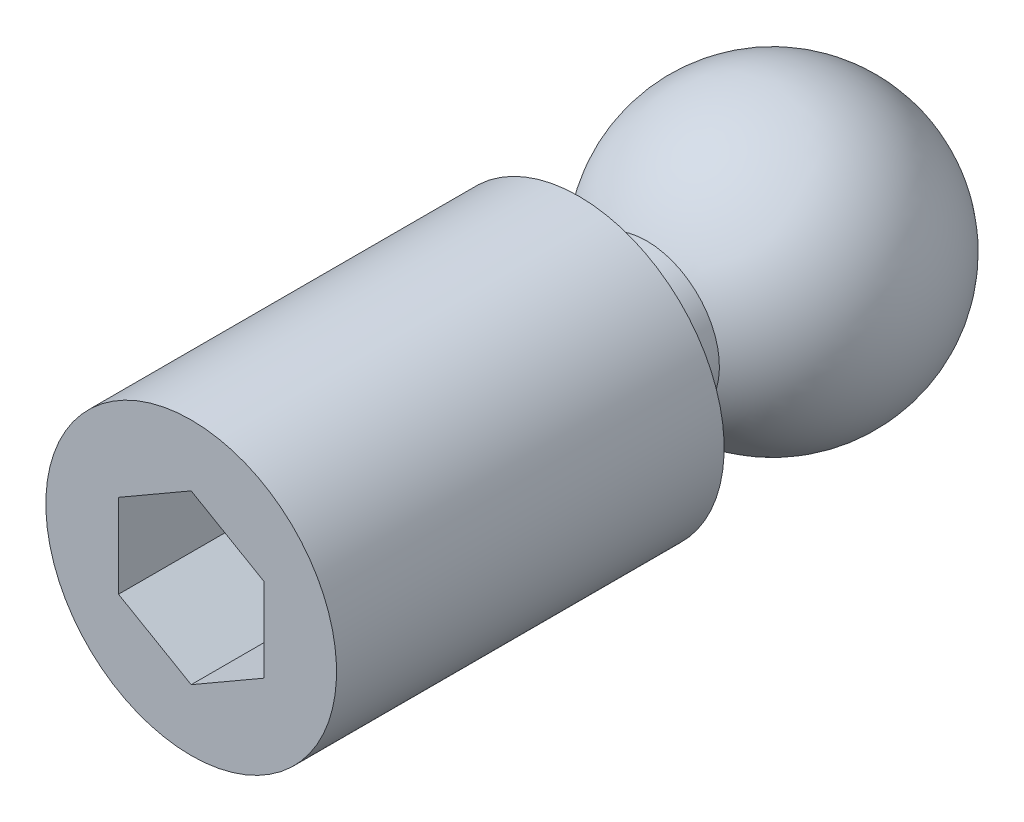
ISO-10303-21;
HEADER;
FILE_DESCRIPTION(('STEP AP214'),'2;1');
FILE_NAME('part.step','',(''),(''),'','','');
FILE_SCHEMA(('AUTOMOTIVE_DESIGN { 1 0 10303 214 1 1 1 1 }'));
ENDSEC;
DATA;
#1=APPLICATION_CONTEXT('core data for automotive mechanical design processes');
#2=APPLICATION_PROTOCOL_DEFINITION('international standard','automotive_design',2000,#1);
#3=PRODUCT_CONTEXT('',#1,'mechanical');
#4=PRODUCT('Part','Part','',(#3));
#5=PRODUCT_RELATED_PRODUCT_CATEGORY('part','',(#4));
#6=PRODUCT_DEFINITION_FORMATION('','',#4);
#7=PRODUCT_DEFINITION_CONTEXT('part definition',#1,'design');
#8=PRODUCT_DEFINITION('design','',#6,#7);
#9=PRODUCT_DEFINITION_SHAPE('','',#8);
#10=(LENGTH_UNIT() NAMED_UNIT(*) SI_UNIT(.MILLI.,.METRE.));
#11=(NAMED_UNIT(*) PLANE_ANGLE_UNIT() SI_UNIT($,.RADIAN.));
#12=(NAMED_UNIT(*) SI_UNIT($,.STERADIAN.) SOLID_ANGLE_UNIT());
#13=UNCERTAINTY_MEASURE_WITH_UNIT(LENGTH_MEASURE(1.E-05),#10,'distance_accuracy_value','');
#14=(GEOMETRIC_REPRESENTATION_CONTEXT(3) GLOBAL_UNCERTAINTY_ASSIGNED_CONTEXT((#13)) GLOBAL_UNIT_ASSIGNED_CONTEXT((#10,
#11,#12)) REPRESENTATION_CONTEXT('',''));
#15=CARTESIAN_POINT('',(0.,0.,0.));
#16=DIRECTION('',(0.,0.,1.));
#17=DIRECTION('',(1.,0.,0.));
#18=AXIS2_PLACEMENT_3D('',#15,#16,#17);
#19=CARTESIAN_POINT('',(0.,0.,3.));
#20=DIRECTION('',(0.,-1.,0.));
#21=DIRECTION('',(-1.,0.,0.));
#22=AXIS2_PLACEMENT_3D('',#19,#20,#21);
#23=SPHERICAL_SURFACE('',#22,3.);
#24=CARTESIAN_POINT('',(0.,0.,3.));
#25=DIRECTION('',(0.,0.,1.));
#26=DIRECTION('',(0.,1.,0.));
#27=AXIS2_PLACEMENT_3D('',#24,#25,#26);
#28=SPHERICAL_SURFACE('',#27,3.);
#29=CARTESIAN_POINT('',(0.,0.,5.59807621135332));
#30=DIRECTION('',(0.,0.,1.));
#31=DIRECTION('',(0.,1.,0.));
#32=AXIS2_PLACEMENT_3D('',#29,#30,#31);
#33=CIRCLE('',#32,1.5);
#34=CARTESIAN_POINT('',(0.,1.5,5.59807621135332));
#35=VERTEX_POINT('',#34);
#36=EDGE_CURVE('E9',#35,#35,#33,.T.);
#37=ORIENTED_EDGE('',*,*,#36,.F.);
#38=EDGE_LOOP('',(#37));
#39=FACE_BOUND('',#38,.T.);
#40=ADVANCED_FACE('F14',(#39),#28,.T.);
#41=CARTESIAN_POINT('',(0.,0.,30.));
#42=DIRECTION('',(0.,0.,1.));
#43=DIRECTION('',(0.,1.,0.));
#44=AXIS2_PLACEMENT_3D('',#41,#42,#43);
#45=CYLINDRICAL_SURFACE('',#44,1.5);
#46=ORIENTED_EDGE('',*,*,#36,.T.);
#47=EDGE_LOOP('',(#46));
#48=FACE_BOUND('',#47,.T.);
#49=CARTESIAN_POINT('',(0.,0.,7.));
#50=DIRECTION('',(0.,0.,1.));
#51=DIRECTION('',(0.,1.,0.));
#52=AXIS2_PLACEMENT_3D('',#49,#50,#51);
#53=CIRCLE('',#52,1.5);
#54=CARTESIAN_POINT('',(0.,1.5,7.));
#55=VERTEX_POINT('',#54);
#56=EDGE_CURVE('E21',#55,#55,#53,.T.);
#57=ORIENTED_EDGE('',*,*,#56,.F.);
#58=EDGE_LOOP('',(#57));
#59=FACE_BOUND('',#58,.T.);
#60=ADVANCED_FACE('F131',(#48,#59),#45,.T.);
#61=CARTESIAN_POINT('',(0.,-3.,7.));
#62=DIRECTION('',(0.,0.,-1.));
#63=DIRECTION('',(0.,-1.,0.));
#64=AXIS2_PLACEMENT_3D('',#61,#62,#63);
#65=PLANE('',#64);
#66=ORIENTED_EDGE('',*,*,#56,.T.);
#67=EDGE_LOOP('',(#66));
#68=FACE_BOUND('',#67,.T.);
#69=CARTESIAN_POINT('',(0.,0.,7.));
#70=DIRECTION('',(0.,0.,1.));
#71=DIRECTION('',(0.,1.,0.));
#72=AXIS2_PLACEMENT_3D('',#69,#70,#71);
#73=CIRCLE('',#72,3.);
#74=CARTESIAN_POINT('',(0.,3.,7.));
#75=VERTEX_POINT('',#74);
#76=EDGE_CURVE('E123',#75,#75,#73,.T.);
#77=ORIENTED_EDGE('',*,*,#76,.F.);
#78=EDGE_LOOP('',(#77));
#79=FACE_BOUND('',#78,.T.);
#80=ADVANCED_FACE('F128',(#68,#79),#65,.T.);
#81=CARTESIAN_POINT('',(0.,0.,30.));
#82=DIRECTION('',(0.,0.,1.));
#83=DIRECTION('',(0.,1.,0.));
#84=AXIS2_PLACEMENT_3D('',#81,#82,#83);
#85=CYLINDRICAL_SURFACE('',#84,3.);
#86=ORIENTED_EDGE('',*,*,#76,.T.);
#87=EDGE_LOOP('',(#86));
#88=FACE_BOUND('',#87,.T.);
#89=CARTESIAN_POINT('',(0.,0.,15.));
#90=DIRECTION('',(0.,0.,1.));
#91=DIRECTION('',(0.,1.,0.));
#92=AXIS2_PLACEMENT_3D('',#89,#90,#91);
#93=CIRCLE('',#92,3.);
#94=CARTESIAN_POINT('',(0.,3.,15.));
#95=VERTEX_POINT('',#94);
#96=EDGE_CURVE('E115',#95,#95,#93,.T.);
#97=ORIENTED_EDGE('',*,*,#96,.F.);
#98=EDGE_LOOP('',(#97));
#99=FACE_BOUND('',#98,.T.);
#100=ADVANCED_FACE('F139',(#88,#99),#85,.T.);
#101=CARTESIAN_POINT('',(0.,0.,15.));
#102=DIRECTION('',(0.,0.,1.));
#103=DIRECTION('',(0.,1.,0.));
#104=AXIS2_PLACEMENT_3D('',#101,#102,#103);
#105=PLANE('',#104);
#106=DIRECTION('',(-0.866025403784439,0.5,0.));
#107=VECTOR('',#106,1.);
#108=CARTESIAN_POINT('',(1.5,0.86602540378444,15.));
#109=LINE('',#108,#107);
#110=CARTESIAN_POINT('',(1.5,0.86602540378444,15.));
#111=VERTEX_POINT('',#110);
#112=CARTESIAN_POINT('',(0.,1.73205080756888,15.));
#113=VERTEX_POINT('',#112);
#114=EDGE_CURVE('E28',#111,#113,#109,.T.);
#115=ORIENTED_EDGE('',*,*,#114,.F.);
#116=DIRECTION('',(0.,1.,0.));
#117=VECTOR('',#116,1.);
#118=CARTESIAN_POINT('',(1.5,-0.866025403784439,15.));
#119=LINE('',#118,#117);
#120=CARTESIAN_POINT('',(1.5,-0.866025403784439,15.));
#121=VERTEX_POINT('',#120);
#122=EDGE_CURVE('E111',#121,#111,#119,.T.);
#123=ORIENTED_EDGE('',*,*,#122,.F.);
#124=DIRECTION('',(0.866025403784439,0.5,0.));
#125=VECTOR('',#124,1.);
#126=CARTESIAN_POINT('',(0.,-1.73205080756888,15.));
#127=LINE('',#126,#125);
#128=CARTESIAN_POINT('',(0.,-1.73205080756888,15.));
#129=VERTEX_POINT('',#128);
#130=EDGE_CURVE('E109',#129,#121,#127,.T.);
#131=ORIENTED_EDGE('',*,*,#130,.F.);
#132=DIRECTION('',(0.866025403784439,-0.5,0.));
#133=VECTOR('',#132,1.);
#134=CARTESIAN_POINT('',(-1.5,-0.866025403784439,15.));
#135=LINE('',#134,#133);
#136=CARTESIAN_POINT('',(-1.5,-0.866025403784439,15.));
#137=VERTEX_POINT('',#136);
#138=EDGE_CURVE('E76',#137,#129,#135,.T.);
#139=ORIENTED_EDGE('',*,*,#138,.F.);
#140=DIRECTION('',(0.,-1.,0.));
#141=VECTOR('',#140,1.);
#142=CARTESIAN_POINT('',(-1.5,0.866025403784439,15.));
#143=LINE('',#142,#141);
#144=CARTESIAN_POINT('',(-1.5,0.866025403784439,15.));
#145=VERTEX_POINT('',#144);
#146=EDGE_CURVE('E105',#145,#137,#143,.T.);
#147=ORIENTED_EDGE('',*,*,#146,.F.);
#148=DIRECTION('',(-0.866025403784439,-0.5,0.));
#149=VECTOR('',#148,1.);
#150=CARTESIAN_POINT('',(0.,1.73205080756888,15.));
#151=LINE('',#150,#149);
#152=EDGE_CURVE('E102',#113,#145,#151,.T.);
#153=ORIENTED_EDGE('',*,*,#152,.F.);
#154=EDGE_LOOP('',(#115,#123,#131,#139,#147,#153));
#155=FACE_BOUND('',#154,.T.);
#156=ORIENTED_EDGE('',*,*,#96,.T.);
#157=EDGE_LOOP('',(#156));
#158=FACE_BOUND('',#157,.T.);
#159=ADVANCED_FACE('F145',(#155,#158),#105,.T.);
#160=CARTESIAN_POINT('',(1.5,0.86602540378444,11.));
#161=DIRECTION('',(0.5,0.866025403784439,0.));
#162=DIRECTION('',(-0.866025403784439,0.5,0.));
#163=AXIS2_PLACEMENT_3D('',#160,#161,#162);
#164=PLANE('',#163);
#165=ORIENTED_EDGE('',*,*,#114,.T.);
#166=DIRECTION('',(0.,0.,1.));
#167=VECTOR('',#166,1.);
#168=CARTESIAN_POINT('',(0.,1.73205080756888,11.));
#169=LINE('',#168,#167);
#170=CARTESIAN_POINT('',(0.,1.73205080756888,11.));
#171=VERTEX_POINT('',#170);
#172=EDGE_CURVE('E58',#171,#113,#169,.T.);
#173=ORIENTED_EDGE('',*,*,#172,.F.);
#174=DIRECTION('',(-0.866025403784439,0.5,0.));
#175=VECTOR('',#174,1.);
#176=CARTESIAN_POINT('',(1.5,0.86602540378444,11.));
#177=LINE('',#176,#175);
#178=CARTESIAN_POINT('',(1.5,0.86602540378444,11.));
#179=VERTEX_POINT('',#178);
#180=EDGE_CURVE('E113',#179,#171,#177,.T.);
#181=ORIENTED_EDGE('',*,*,#180,.F.);
#182=DIRECTION('',(0.,0.,1.));
#183=VECTOR('',#182,1.);
#184=CARTESIAN_POINT('',(1.5,0.86602540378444,11.));
#185=LINE('',#184,#183);
#186=EDGE_CURVE('E36',#179,#111,#185,.T.);
#187=ORIENTED_EDGE('',*,*,#186,.T.);
#188=EDGE_LOOP('',(#165,#173,#181,#187));
#189=FACE_BOUND('',#188,.T.);
#190=ADVANCED_FACE('F149',(#189),#164,.F.);
#191=CARTESIAN_POINT('',(1.5,-0.866025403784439,11.));
#192=DIRECTION('',(1.,0.,0.));
#193=DIRECTION('',(0.,1.,0.));
#194=AXIS2_PLACEMENT_3D('',#191,#192,#193);
#195=PLANE('',#194);
#196=ORIENTED_EDGE('',*,*,#122,.T.);
#197=ORIENTED_EDGE('',*,*,#186,.F.);
#198=DIRECTION('',(0.,1.,0.));
#199=VECTOR('',#198,1.);
#200=CARTESIAN_POINT('',(1.5,-0.866025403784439,11.));
#201=LINE('',#200,#199);
#202=CARTESIAN_POINT('',(1.5,-0.866025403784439,11.));
#203=VERTEX_POINT('',#202);
#204=EDGE_CURVE('E88',#203,#179,#201,.T.);
#205=ORIENTED_EDGE('',*,*,#204,.F.);
#206=DIRECTION('',(0.,0.,1.));
#207=VECTOR('',#206,1.);
#208=CARTESIAN_POINT('',(1.5,-0.866025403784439,11.));
#209=LINE('',#208,#207);
#210=EDGE_CURVE('E80',#203,#121,#209,.T.);
#211=ORIENTED_EDGE('',*,*,#210,.T.);
#212=EDGE_LOOP('',(#196,#197,#205,#211));
#213=FACE_BOUND('',#212,.T.);
#214=ADVANCED_FACE('F153',(#213),#195,.F.);
#215=CARTESIAN_POINT('',(0.,-1.73205080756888,11.));
#216=DIRECTION('',(0.5,-0.866025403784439,0.));
#217=DIRECTION('',(0.866025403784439,0.5,0.));
#218=AXIS2_PLACEMENT_3D('',#215,#216,#217);
#219=PLANE('',#218);
#220=ORIENTED_EDGE('',*,*,#130,.T.);
#221=ORIENTED_EDGE('',*,*,#210,.F.);
#222=DIRECTION('',(0.866025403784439,0.5,0.));
#223=VECTOR('',#222,1.);
#224=CARTESIAN_POINT('',(0.,-1.73205080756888,11.));
#225=LINE('',#224,#223);
#226=CARTESIAN_POINT('',(0.,-1.73205080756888,11.));
#227=VERTEX_POINT('',#226);
#228=EDGE_CURVE('E84',#227,#203,#225,.T.);
#229=ORIENTED_EDGE('',*,*,#228,.F.);
#230=DIRECTION('',(0.,0.,1.));
#231=VECTOR('',#230,1.);
#232=CARTESIAN_POINT('',(0.,-1.73205080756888,11.));
#233=LINE('',#232,#231);
#234=EDGE_CURVE('E69',#227,#129,#233,.T.);
#235=ORIENTED_EDGE('',*,*,#234,.T.);
#236=EDGE_LOOP('',(#220,#221,#229,#235));
#237=FACE_BOUND('',#236,.T.);
#238=ADVANCED_FACE('F85',(#237),#219,.F.);
#239=CARTESIAN_POINT('',(-1.5,-0.866025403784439,11.));
#240=DIRECTION('',(-0.5,-0.866025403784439,0.));
#241=DIRECTION('',(0.866025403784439,-0.5,0.));
#242=AXIS2_PLACEMENT_3D('',#239,#240,#241);
#243=PLANE('',#242);
#244=ORIENTED_EDGE('',*,*,#138,.T.);
#245=ORIENTED_EDGE('',*,*,#234,.F.);
#246=DIRECTION('',(0.866025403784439,-0.5,0.));
#247=VECTOR('',#246,1.);
#248=CARTESIAN_POINT('',(-1.5,-0.866025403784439,11.));
#249=LINE('',#248,#247);
#250=CARTESIAN_POINT('',(-1.5,-0.866025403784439,11.));
#251=VERTEX_POINT('',#250);
#252=EDGE_CURVE('E73',#251,#227,#249,.T.);
#253=ORIENTED_EDGE('',*,*,#252,.F.);
#254=DIRECTION('',(0.,0.,1.));
#255=VECTOR('',#254,1.);
#256=CARTESIAN_POINT('',(-1.5,-0.866025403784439,11.));
#257=LINE('',#256,#255);
#258=EDGE_CURVE('E81',#251,#137,#257,.T.);
#259=ORIENTED_EDGE('',*,*,#258,.T.);
#260=EDGE_LOOP('',(#244,#245,#253,#259));
#261=FACE_BOUND('',#260,.T.);
#262=ADVANCED_FACE('F71',(#261),#243,.F.);
#263=CARTESIAN_POINT('',(-1.5,0.866025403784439,11.));
#264=DIRECTION('',(-1.,0.,0.));
#265=DIRECTION('',(0.,-1.,0.));
#266=AXIS2_PLACEMENT_3D('',#263,#264,#265);
#267=PLANE('',#266);
#268=ORIENTED_EDGE('',*,*,#146,.T.);
#269=ORIENTED_EDGE('',*,*,#258,.F.);
#270=DIRECTION('',(0.,-1.,0.));
#271=VECTOR('',#270,1.);
#272=CARTESIAN_POINT('',(-1.5,0.866025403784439,11.));
#273=LINE('',#272,#271);
#274=CARTESIAN_POINT('',(-1.5,0.866025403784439,11.));
#275=VERTEX_POINT('',#274);
#276=EDGE_CURVE('E94',#275,#251,#273,.T.);
#277=ORIENTED_EDGE('',*,*,#276,.F.);
#278=DIRECTION('',(0.,0.,1.));
#279=VECTOR('',#278,1.);
#280=CARTESIAN_POINT('',(-1.5,0.866025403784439,11.));
#281=LINE('',#280,#279);
#282=EDGE_CURVE('E118',#275,#145,#281,.T.);
#283=ORIENTED_EDGE('',*,*,#282,.T.);
#284=EDGE_LOOP('',(#268,#269,#277,#283));
#285=FACE_BOUND('',#284,.T.);
#286=ADVANCED_FACE('F157',(#285),#267,.F.);
#287=CARTESIAN_POINT('',(0.,1.73205080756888,11.));
#288=DIRECTION('',(-0.5,0.866025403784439,0.));
#289=DIRECTION('',(-0.866025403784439,-0.5,0.));
#290=AXIS2_PLACEMENT_3D('',#287,#288,#289);
#291=PLANE('',#290);
#292=ORIENTED_EDGE('',*,*,#152,.T.);
#293=ORIENTED_EDGE('',*,*,#282,.F.);
#294=DIRECTION('',(-0.866025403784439,-0.5,0.));
#295=VECTOR('',#294,1.);
#296=CARTESIAN_POINT('',(0.,1.73205080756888,11.));
#297=LINE('',#296,#295);
#298=EDGE_CURVE('E96',#171,#275,#297,.T.);
#299=ORIENTED_EDGE('',*,*,#298,.F.);
#300=ORIENTED_EDGE('',*,*,#172,.T.);
#301=EDGE_LOOP('',(#292,#293,#299,#300));
#302=FACE_BOUND('',#301,.T.);
#303=ADVANCED_FACE('F154',(#302),#291,.F.);
#304=CARTESIAN_POINT('',(0.,1.73205080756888,11.));
#305=DIRECTION('',(0.,0.,1.));
#306=DIRECTION('',(1.,0.,0.));
#307=AXIS2_PLACEMENT_3D('',#304,#305,#306);
#308=PLANE('',#307);
#309=ORIENTED_EDGE('',*,*,#180,.T.);
#310=ORIENTED_EDGE('',*,*,#298,.T.);
#311=ORIENTED_EDGE('',*,*,#276,.T.);
#312=ORIENTED_EDGE('',*,*,#252,.T.);
#313=ORIENTED_EDGE('',*,*,#228,.T.);
#314=ORIENTED_EDGE('',*,*,#204,.T.);
#315=EDGE_LOOP('',(#309,#310,#311,#312,#313,#314));
#316=FACE_BOUND('',#315,.T.);
#317=ADVANCED_FACE('F91',(#316),#308,.T.);
#318=CLOSED_SHELL('',(#40,#60,#80,#100,#159,#190,#214,#238,#262,#286,#303,#317));
#319=MANIFOLD_SOLID_BREP('B1',#318);
#320=ADVANCED_BREP_SHAPE_REPRESENTATION('',(#18,#319),#14);
#321=SHAPE_DEFINITION_REPRESENTATION(#9,#320);
ENDSEC;
END-ISO-10303-21;
